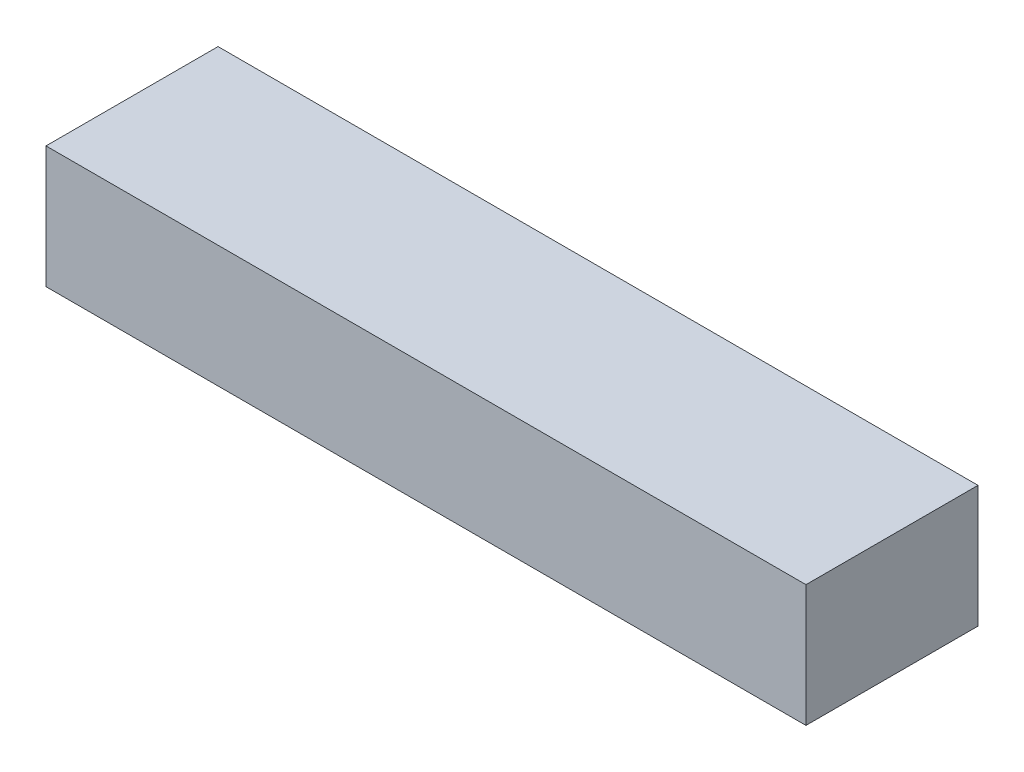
ISO-10303-21;
HEADER;
FILE_DESCRIPTION(('STEP AP214'),'2;1');
FILE_NAME('part.step','',(''),(''),'','','');
FILE_SCHEMA(('AUTOMOTIVE_DESIGN { 1 0 10303 214 1 1 1 1 }'));
ENDSEC;
DATA;
#1=APPLICATION_CONTEXT('core data for automotive mechanical design processes');
#2=APPLICATION_PROTOCOL_DEFINITION('international standard','automotive_design',2000,#1);
#3=PRODUCT_CONTEXT('',#1,'mechanical');
#4=PRODUCT('Part','Part','',(#3));
#5=PRODUCT_RELATED_PRODUCT_CATEGORY('part','',(#4));
#6=PRODUCT_DEFINITION_FORMATION('','',#4);
#7=PRODUCT_DEFINITION_CONTEXT('part definition',#1,'design');
#8=PRODUCT_DEFINITION('design','',#6,#7);
#9=PRODUCT_DEFINITION_SHAPE('','',#8);
#10=(LENGTH_UNIT() NAMED_UNIT(*) SI_UNIT(.MILLI.,.METRE.));
#11=(NAMED_UNIT(*) PLANE_ANGLE_UNIT() SI_UNIT($,.RADIAN.));
#12=(NAMED_UNIT(*) SI_UNIT($,.STERADIAN.) SOLID_ANGLE_UNIT());
#13=UNCERTAINTY_MEASURE_WITH_UNIT(LENGTH_MEASURE(1.E-05),#10,'distance_accuracy_value','');
#14=(GEOMETRIC_REPRESENTATION_CONTEXT(3) GLOBAL_UNCERTAINTY_ASSIGNED_CONTEXT((#13)) GLOBAL_UNIT_ASSIGNED_CONTEXT((#10,
#11,#12)) REPRESENTATION_CONTEXT('',''));
#15=CARTESIAN_POINT('',(0.,0.,0.));
#16=DIRECTION('',(0.,0.,1.));
#17=DIRECTION('',(1.,0.,0.));
#18=AXIS2_PLACEMENT_3D('',#15,#16,#17);
#19=CARTESIAN_POINT('',(0.,0.,6.35));
#20=DIRECTION('',(1.,0.,0.));
#21=DIRECTION('',(0.,0.,-1.));
#22=AXIS2_PLACEMENT_3D('',#19,#20,#21);
#23=PLANE('',#22);
#24=DIRECTION('',(0.,-1.,0.));
#25=VECTOR('',#24,1.);
#26=CARTESIAN_POINT('',(0.,0.,0.));
#27=LINE('',#26,#25);
#28=CARTESIAN_POINT('',(0.,4.5,0.));
#29=VERTEX_POINT('',#28);
#30=CARTESIAN_POINT('',(0.,0.,0.));
#31=VERTEX_POINT('',#30);
#32=EDGE_CURVE('E96',#29,#31,#27,.T.);
#33=ORIENTED_EDGE('',*,*,#32,.T.);
#34=DIRECTION('',(0.,0.,-1.));
#35=VECTOR('',#34,1.);
#36=CARTESIAN_POINT('',(0.,0.,6.35));
#37=LINE('',#36,#35);
#38=CARTESIAN_POINT('',(0.,0.,6.35));
#39=VERTEX_POINT('',#38);
#40=EDGE_CURVE('E11',#39,#31,#37,.T.);
#41=ORIENTED_EDGE('',*,*,#40,.F.);
#42=DIRECTION('',(0.,-1.,0.));
#43=VECTOR('',#42,1.);
#44=CARTESIAN_POINT('',(0.,0.,6.35));
#45=LINE('',#44,#43);
#46=CARTESIAN_POINT('',(0.,4.5,6.35));
#47=VERTEX_POINT('',#46);
#48=EDGE_CURVE('E84',#47,#39,#45,.T.);
#49=ORIENTED_EDGE('',*,*,#48,.F.);
#50=DIRECTION('',(0.,0.,-1.));
#51=VECTOR('',#50,1.);
#52=CARTESIAN_POINT('',(0.,4.5,6.35));
#53=LINE('',#52,#51);
#54=EDGE_CURVE('E92',#47,#29,#53,.T.);
#55=ORIENTED_EDGE('',*,*,#54,.T.);
#56=EDGE_LOOP('',(#33,#41,#49,#55));
#57=FACE_BOUND('',#56,.T.);
#58=ADVANCED_FACE('F33',(#57),#23,.F.);
#59=CARTESIAN_POINT('',(0.,0.,6.35));
#60=DIRECTION('',(0.,1.,0.));
#61=DIRECTION('',(0.,0.,1.));
#62=AXIS2_PLACEMENT_3D('',#59,#60,#61);
#63=PLANE('',#62);
#64=DIRECTION('',(1.,0.,0.));
#65=VECTOR('',#64,1.);
#66=CARTESIAN_POINT('',(0.,0.,0.));
#67=LINE('',#66,#65);
#68=CARTESIAN_POINT('',(28.05,0.,0.));
#69=VERTEX_POINT('',#68);
#70=EDGE_CURVE('E88',#31,#69,#67,.T.);
#71=ORIENTED_EDGE('',*,*,#70,.T.);
#72=DIRECTION('',(0.,0.,-1.));
#73=VECTOR('',#72,1.);
#74=CARTESIAN_POINT('',(28.05,0.,6.35));
#75=LINE('',#74,#73);
#76=CARTESIAN_POINT('',(28.05,0.,6.35));
#77=VERTEX_POINT('',#76);
#78=EDGE_CURVE('E41',#77,#69,#75,.T.);
#79=ORIENTED_EDGE('',*,*,#78,.F.);
#80=DIRECTION('',(1.,0.,0.));
#81=VECTOR('',#80,1.);
#82=CARTESIAN_POINT('',(0.,0.,6.35));
#83=LINE('',#82,#81);
#84=EDGE_CURVE('E79',#39,#77,#83,.T.);
#85=ORIENTED_EDGE('',*,*,#84,.F.);
#86=ORIENTED_EDGE('',*,*,#40,.T.);
#87=EDGE_LOOP('',(#71,#79,#85,#86));
#88=FACE_BOUND('',#87,.T.);
#89=ADVANCED_FACE('F87',(#88),#63,.F.);
#90=CARTESIAN_POINT('',(28.05,0.,6.35));
#91=DIRECTION('',(-1.,0.,0.));
#92=DIRECTION('',(0.,0.,1.));
#93=AXIS2_PLACEMENT_3D('',#90,#91,#92);
#94=PLANE('',#93);
#95=DIRECTION('',(0.,1.,0.));
#96=VECTOR('',#95,1.);
#97=CARTESIAN_POINT('',(28.05,0.,0.));
#98=LINE('',#97,#96);
#99=CARTESIAN_POINT('',(28.05,4.5,0.));
#100=VERTEX_POINT('',#99);
#101=EDGE_CURVE('E66',#69,#100,#98,.T.);
#102=ORIENTED_EDGE('',*,*,#101,.T.);
#103=DIRECTION('',(0.,0.,-1.));
#104=VECTOR('',#103,1.);
#105=CARTESIAN_POINT('',(28.05,4.5,6.35));
#106=LINE('',#105,#104);
#107=CARTESIAN_POINT('',(28.05,4.5,6.35));
#108=VERTEX_POINT('',#107);
#109=EDGE_CURVE('E89',#108,#100,#106,.T.);
#110=ORIENTED_EDGE('',*,*,#109,.F.);
#111=DIRECTION('',(0.,1.,0.));
#112=VECTOR('',#111,1.);
#113=CARTESIAN_POINT('',(28.05,0.,6.35));
#114=LINE('',#113,#112);
#115=EDGE_CURVE('E82',#77,#108,#114,.T.);
#116=ORIENTED_EDGE('',*,*,#115,.F.);
#117=ORIENTED_EDGE('',*,*,#78,.T.);
#118=EDGE_LOOP('',(#102,#110,#116,#117));
#119=FACE_BOUND('',#118,.T.);
#120=ADVANCED_FACE('F90',(#119),#94,.F.);
#121=CARTESIAN_POINT('',(0.,4.5,6.35));
#122=DIRECTION('',(0.,-1.,0.));
#123=DIRECTION('',(0.,0.,-1.));
#124=AXIS2_PLACEMENT_3D('',#121,#122,#123);
#125=PLANE('',#124);
#126=DIRECTION('',(-1.,0.,0.));
#127=VECTOR('',#126,1.);
#128=CARTESIAN_POINT('',(0.,4.5,0.));
#129=LINE('',#128,#127);
#130=EDGE_CURVE('E72',#100,#29,#129,.T.);
#131=ORIENTED_EDGE('',*,*,#130,.T.);
#132=ORIENTED_EDGE('',*,*,#54,.F.);
#133=DIRECTION('',(-1.,0.,0.));
#134=VECTOR('',#133,1.);
#135=CARTESIAN_POINT('',(0.,4.5,6.35));
#136=LINE('',#135,#134);
#137=EDGE_CURVE('E49',#108,#47,#136,.T.);
#138=ORIENTED_EDGE('',*,*,#137,.F.);
#139=ORIENTED_EDGE('',*,*,#109,.T.);
#140=EDGE_LOOP('',(#131,#132,#138,#139));
#141=FACE_BOUND('',#140,.T.);
#142=ADVANCED_FACE('F103',(#141),#125,.F.);
#143=CARTESIAN_POINT('',(0.,0.,6.35));
#144=DIRECTION('',(0.,0.,-1.));
#145=DIRECTION('',(-1.,0.,0.));
#146=AXIS2_PLACEMENT_3D('',#143,#144,#145);
#147=PLANE('',#146);
#148=ORIENTED_EDGE('',*,*,#48,.T.);
#149=ORIENTED_EDGE('',*,*,#84,.T.);
#150=ORIENTED_EDGE('',*,*,#115,.T.);
#151=ORIENTED_EDGE('',*,*,#137,.T.);
#152=EDGE_LOOP('',(#148,#149,#150,#151));
#153=FACE_BOUND('',#152,.T.);
#154=ADVANCED_FACE('F80',(#153),#147,.F.);
#155=CARTESIAN_POINT('',(0.,0.,0.));
#156=DIRECTION('',(0.,0.,-1.));
#157=DIRECTION('',(-1.,0.,0.));
#158=AXIS2_PLACEMENT_3D('',#155,#156,#157);
#159=PLANE('',#158);
#160=ORIENTED_EDGE('',*,*,#32,.F.);
#161=ORIENTED_EDGE('',*,*,#130,.F.);
#162=ORIENTED_EDGE('',*,*,#101,.F.);
#163=ORIENTED_EDGE('',*,*,#70,.F.);
#164=EDGE_LOOP('',(#160,#161,#162,#163));
#165=FACE_BOUND('',#164,.T.);
#166=ADVANCED_FACE('F106',(#165),#159,.T.);
#167=CLOSED_SHELL('',(#58,#89,#120,#142,#154,#166));
#168=MANIFOLD_SOLID_BREP('B2',#167);
#169=ADVANCED_BREP_SHAPE_REPRESENTATION('',(#18,#168),#14);
#170=SHAPE_DEFINITION_REPRESENTATION(#9,#169);
ENDSEC;
END-ISO-10303-21;
